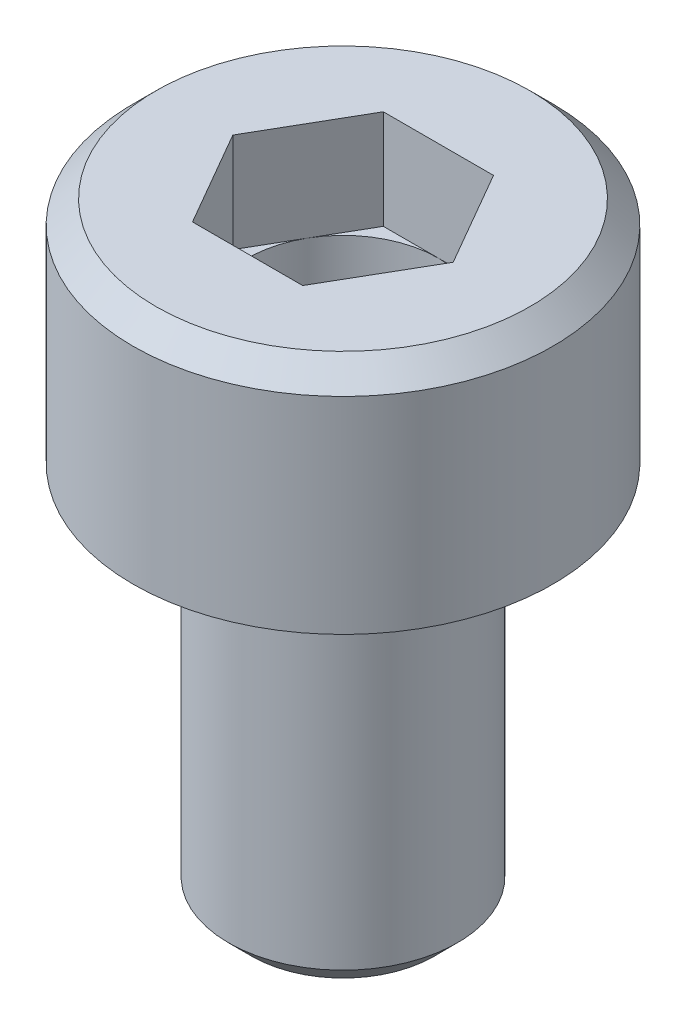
ISO-10303-21;
HEADER;
FILE_DESCRIPTION(('STEP AP214'),'2;1');
FILE_NAME('part.step','',(''),(''),'','','');
FILE_SCHEMA(('AUTOMOTIVE_DESIGN { 1 0 10303 214 1 1 1 1 }'));
ENDSEC;
DATA;
#1=APPLICATION_CONTEXT('core data for automotive mechanical design processes');
#2=APPLICATION_PROTOCOL_DEFINITION('international standard','automotive_design',2000,#1);
#3=PRODUCT_CONTEXT('',#1,'mechanical');
#4=PRODUCT('Part','Part','',(#3));
#5=PRODUCT_RELATED_PRODUCT_CATEGORY('part','',(#4));
#6=PRODUCT_DEFINITION_FORMATION('','',#4);
#7=PRODUCT_DEFINITION_CONTEXT('part definition',#1,'design');
#8=PRODUCT_DEFINITION('design','',#6,#7);
#9=PRODUCT_DEFINITION_SHAPE('','',#8);
#10=(LENGTH_UNIT() NAMED_UNIT(*) SI_UNIT(.MILLI.,.METRE.));
#11=(NAMED_UNIT(*) PLANE_ANGLE_UNIT() SI_UNIT($,.RADIAN.));
#12=(NAMED_UNIT(*) SI_UNIT($,.STERADIAN.) SOLID_ANGLE_UNIT());
#13=UNCERTAINTY_MEASURE_WITH_UNIT(LENGTH_MEASURE(1.E-05),#10,'distance_accuracy_value','');
#14=(GEOMETRIC_REPRESENTATION_CONTEXT(3) GLOBAL_UNCERTAINTY_ASSIGNED_CONTEXT((#13)) GLOBAL_UNIT_ASSIGNED_CONTEXT((#10,
#11,#12)) REPRESENTATION_CONTEXT('',''));
#15=CARTESIAN_POINT('',(0.,0.,0.));
#16=DIRECTION('',(0.,0.,1.));
#17=DIRECTION('',(1.,0.,0.));
#18=AXIS2_PLACEMENT_3D('',#15,#16,#17);
#19=CARTESIAN_POINT('',(0.,1.14999999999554,0.));
#20=DIRECTION('',(0.,1.,0.));
#21=DIRECTION('',(0.,0.,1.));
#22=AXIS2_PLACEMENT_3D('',#19,#20,#21);
#23=CONICAL_SURFACE('',#22,1.25000000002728,1.04719755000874);
#24=CARTESIAN_POINT('',(0.,0.428312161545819,-5.6843418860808E-11));
#25=VERTEX_POINT('',#24);
#26=VERTEX_LOOP('',#25);
#27=FACE_BOUND('',#26,.T.);
#28=CARTESIAN_POINT('',(0.,1.15,0.));
#29=DIRECTION('',(0.,-1.,0.));
#30=DIRECTION('',(0.,0.,-1.));
#31=AXIS2_PLACEMENT_3D('',#28,#29,#30);
#32=CIRCLE('',#31,1.25);
#33=CARTESIAN_POINT('',(0.,1.15,-1.25));
#34=VERTEX_POINT('',#33);
#35=EDGE_CURVE('E99',#34,#34,#32,.F.);
#36=ORIENTED_EDGE('',*,*,#35,.T.);
#37=EDGE_LOOP('',(#36));
#38=FACE_BOUND('',#37,.T.);
#39=ADVANCED_FACE('F17',(#27,#38),#23,.F.);
#40=CARTESIAN_POINT('',(0.,3.,0.));
#41=DIRECTION('',(0.,-1.,0.));
#42=DIRECTION('',(0.,0.,-1.));
#43=AXIS2_PLACEMENT_3D('',#40,#41,#42);
#44=CYLINDRICAL_SURFACE('',#43,1.25);
#45=CARTESIAN_POINT('',(0.,1.7,0.));
#46=DIRECTION('',(0.,-1.,0.));
#47=DIRECTION('',(0.,0.,-1.));
#48=AXIS2_PLACEMENT_3D('',#45,#46,#47);
#49=CIRCLE('',#48,1.25);
#50=CARTESIAN_POINT('',(0.,1.7,-1.25));
#51=VERTEX_POINT('',#50);
#52=CARTESIAN_POINT('',(-1.08253175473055,1.7,-0.625));
#53=VERTEX_POINT('',#52);
#54=EDGE_CURVE('E20',#51,#53,#49,.F.);
#55=ORIENTED_EDGE('',*,*,#54,.T.);
#56=CARTESIAN_POINT('',(0.,1.7,0.));
#57=DIRECTION('',(0.,-1.,0.));
#58=DIRECTION('',(0.,0.,-1.));
#59=AXIS2_PLACEMENT_3D('',#56,#57,#58);
#60=CIRCLE('',#59,1.25);
#61=CARTESIAN_POINT('',(-1.08253175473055,1.7,0.625));
#62=VERTEX_POINT('',#61);
#63=EDGE_CURVE('E94',#53,#62,#60,.F.);
#64=ORIENTED_EDGE('',*,*,#63,.T.);
#65=CARTESIAN_POINT('',(0.,1.7,0.));
#66=DIRECTION('',(0.,-1.,0.));
#67=DIRECTION('',(0.,0.,-1.));
#68=AXIS2_PLACEMENT_3D('',#65,#66,#67);
#69=CIRCLE('',#68,1.25);
#70=CARTESIAN_POINT('',(0.,1.7,1.25));
#71=VERTEX_POINT('',#70);
#72=EDGE_CURVE('E110',#62,#71,#69,.F.);
#73=ORIENTED_EDGE('',*,*,#72,.T.);
#74=CARTESIAN_POINT('',(0.,1.7,0.));
#75=DIRECTION('',(0.,-1.,0.));
#76=DIRECTION('',(0.,0.,-1.));
#77=AXIS2_PLACEMENT_3D('',#74,#75,#76);
#78=CIRCLE('',#77,1.25);
#79=CARTESIAN_POINT('',(1.08253175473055,1.7,0.625));
#80=VERTEX_POINT('',#79);
#81=EDGE_CURVE('E216',#71,#80,#78,.F.);
#82=ORIENTED_EDGE('',*,*,#81,.T.);
#83=CARTESIAN_POINT('',(0.,1.7,0.));
#84=DIRECTION('',(0.,-1.,0.));
#85=DIRECTION('',(0.,0.,-1.));
#86=AXIS2_PLACEMENT_3D('',#83,#84,#85);
#87=CIRCLE('',#86,1.25);
#88=CARTESIAN_POINT('',(1.08253175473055,1.7,-0.625));
#89=VERTEX_POINT('',#88);
#90=EDGE_CURVE('E218',#80,#89,#87,.F.);
#91=ORIENTED_EDGE('',*,*,#90,.T.);
#92=CARTESIAN_POINT('',(0.,1.7,0.));
#93=DIRECTION('',(0.,-1.,0.));
#94=DIRECTION('',(0.,0.,-1.));
#95=AXIS2_PLACEMENT_3D('',#92,#93,#94);
#96=CIRCLE('',#95,1.25);
#97=EDGE_CURVE('E89',#89,#51,#96,.F.);
#98=ORIENTED_EDGE('',*,*,#97,.T.);
#99=EDGE_LOOP('',(#55,#64,#73,#82,#91,#98));
#100=FACE_BOUND('',#99,.T.);
#101=ORIENTED_EDGE('',*,*,#35,.F.);
#102=EDGE_LOOP('',(#101));
#103=FACE_BOUND('',#102,.T.);
#104=ADVANCED_FACE('F92',(#100,#103),#44,.F.);
#105=CARTESIAN_POINT('',(0.,-5.,0.));
#106=DIRECTION('',(0.,-1.,0.));
#107=DIRECTION('',(0.,0.,-1.));
#108=AXIS2_PLACEMENT_3D('',#105,#106,#107);
#109=PLANE('',#108);
#110=CARTESIAN_POINT('',(0.,-4.99999999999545,0.));
#111=DIRECTION('',(0.,1.,0.));
#112=DIRECTION('',(0.,0.,1.));
#113=AXIS2_PLACEMENT_3D('',#110,#111,#112);
#114=CIRCLE('',#113,1.19327499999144);
#115=CARTESIAN_POINT('',(0.,-4.99999999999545,1.19327499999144));
#116=VERTEX_POINT('',#115);
#117=EDGE_CURVE('E109',#116,#116,#114,.T.);
#118=ORIENTED_EDGE('',*,*,#117,.F.);
#119=EDGE_LOOP('',(#118));
#120=FACE_BOUND('',#119,.T.);
#121=ADVANCED_FACE('F431',(#120),#109,.T.);
#122=CARTESIAN_POINT('',(0.,1.7,0.));
#123=DIRECTION('',(0.,-1.,0.));
#124=DIRECTION('',(0.,0.,-1.));
#125=AXIS2_PLACEMENT_3D('',#122,#123,#124);
#126=PLANE('',#125);
#127=DIRECTION('',(-0.5,0.,0.866025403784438));
#128=VECTOR('',#127,1.);
#129=CARTESIAN_POINT('',(-1.08253175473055,1.7,-0.625));
#130=LINE('',#129,#128);
#131=CARTESIAN_POINT('',(-0.721687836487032,1.7,-1.25));
#132=VERTEX_POINT('',#131);
#133=EDGE_CURVE('E113',#132,#53,#130,.T.);
#134=ORIENTED_EDGE('',*,*,#133,.T.);
#135=ORIENTED_EDGE('',*,*,#54,.F.);
#136=DIRECTION('',(-1.,0.,0.));
#137=VECTOR('',#136,1.);
#138=CARTESIAN_POINT('',(0.,1.7,-1.25));
#139=LINE('',#138,#137);
#140=EDGE_CURVE('E116',#51,#132,#139,.T.);
#141=ORIENTED_EDGE('',*,*,#140,.T.);
#142=EDGE_LOOP('',(#134,#135,#141));
#143=FACE_BOUND('',#142,.T.);
#144=ADVANCED_FACE('F114',(#143),#126,.F.);
#145=CARTESIAN_POINT('',(0.,1.7,0.));
#146=DIRECTION('',(0.,-1.,0.));
#147=DIRECTION('',(0.,0.,-1.));
#148=AXIS2_PLACEMENT_3D('',#145,#146,#147);
#149=PLANE('',#148);
#150=DIRECTION('',(-1.,0.,0.));
#151=VECTOR('',#150,1.);
#152=CARTESIAN_POINT('',(0.,1.7,-1.25));
#153=LINE('',#152,#151);
#154=CARTESIAN_POINT('',(0.721687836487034,1.7,-1.25));
#155=VERTEX_POINT('',#154);
#156=EDGE_CURVE('E188',#155,#51,#153,.T.);
#157=ORIENTED_EDGE('',*,*,#156,.T.);
#158=ORIENTED_EDGE('',*,*,#97,.F.);
#159=DIRECTION('',(0.5,0.,0.866025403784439));
#160=VECTOR('',#159,1.);
#161=CARTESIAN_POINT('',(1.08253175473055,1.7,-0.625));
#162=LINE('',#161,#160);
#163=EDGE_CURVE('E179',#155,#89,#162,.T.);
#164=ORIENTED_EDGE('',*,*,#163,.F.);
#165=EDGE_LOOP('',(#157,#158,#164));
#166=FACE_BOUND('',#165,.T.);
#167=ADVANCED_FACE('F225',(#166),#149,.F.);
#168=CARTESIAN_POINT('',(0.,1.7,0.));
#169=DIRECTION('',(0.,-1.,0.));
#170=DIRECTION('',(0.,0.,-1.));
#171=AXIS2_PLACEMENT_3D('',#168,#169,#170);
#172=PLANE('',#171);
#173=DIRECTION('',(0.5,0.,0.866025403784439));
#174=VECTOR('',#173,1.);
#175=CARTESIAN_POINT('',(1.08253175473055,1.7,-0.625));
#176=LINE('',#175,#174);
#177=CARTESIAN_POINT('',(1.44337567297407,1.7,0.));
#178=VERTEX_POINT('',#177);
#179=EDGE_CURVE('E176',#89,#178,#176,.T.);
#180=ORIENTED_EDGE('',*,*,#179,.F.);
#181=ORIENTED_EDGE('',*,*,#90,.F.);
#182=DIRECTION('',(-0.5,0.,0.866025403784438));
#183=VECTOR('',#182,1.);
#184=CARTESIAN_POINT('',(1.08253175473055,1.7,0.625));
#185=LINE('',#184,#183);
#186=EDGE_CURVE('E164',#178,#80,#185,.T.);
#187=ORIENTED_EDGE('',*,*,#186,.F.);
#188=EDGE_LOOP('',(#180,#181,#187));
#189=FACE_BOUND('',#188,.T.);
#190=ADVANCED_FACE('F227',(#189),#172,.F.);
#191=CARTESIAN_POINT('',(0.,1.7,0.));
#192=DIRECTION('',(0.,-1.,0.));
#193=DIRECTION('',(0.,0.,-1.));
#194=AXIS2_PLACEMENT_3D('',#191,#192,#193);
#195=PLANE('',#194);
#196=DIRECTION('',(-0.5,0.,0.866025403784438));
#197=VECTOR('',#196,1.);
#198=CARTESIAN_POINT('',(1.08253175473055,1.7,0.625));
#199=LINE('',#198,#197);
#200=CARTESIAN_POINT('',(0.721687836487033,1.7,1.25));
#201=VERTEX_POINT('',#200);
#202=EDGE_CURVE('E161',#80,#201,#199,.T.);
#203=ORIENTED_EDGE('',*,*,#202,.F.);
#204=ORIENTED_EDGE('',*,*,#81,.F.);
#205=DIRECTION('',(-1.,0.,0.));
#206=VECTOR('',#205,1.);
#207=CARTESIAN_POINT('',(0.,1.7,1.25));
#208=LINE('',#207,#206);
#209=EDGE_CURVE('E149',#201,#71,#208,.T.);
#210=ORIENTED_EDGE('',*,*,#209,.F.);
#211=EDGE_LOOP('',(#203,#204,#210));
#212=FACE_BOUND('',#211,.T.);
#213=ADVANCED_FACE('F270',(#212),#195,.F.);
#214=CARTESIAN_POINT('',(0.,1.7,0.));
#215=DIRECTION('',(0.,-1.,0.));
#216=DIRECTION('',(0.,0.,-1.));
#217=AXIS2_PLACEMENT_3D('',#214,#215,#216);
#218=PLANE('',#217);
#219=DIRECTION('',(-1.,0.,0.));
#220=VECTOR('',#219,1.);
#221=CARTESIAN_POINT('',(0.,1.7,1.25));
#222=LINE('',#221,#220);
#223=CARTESIAN_POINT('',(-0.721687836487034,1.7,1.25));
#224=VERTEX_POINT('',#223);
#225=EDGE_CURVE('E146',#71,#224,#222,.T.);
#226=ORIENTED_EDGE('',*,*,#225,.F.);
#227=ORIENTED_EDGE('',*,*,#72,.F.);
#228=DIRECTION('',(0.5,0.,0.866025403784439));
#229=VECTOR('',#228,1.);
#230=CARTESIAN_POINT('',(-1.08253175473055,1.7,0.625));
#231=LINE('',#230,#229);
#232=EDGE_CURVE('E153',#62,#224,#231,.T.);
#233=ORIENTED_EDGE('',*,*,#232,.T.);
#234=EDGE_LOOP('',(#226,#227,#233));
#235=FACE_BOUND('',#234,.T.);
#236=ADVANCED_FACE('F267',(#235),#218,.F.);
#237=CARTESIAN_POINT('',(0.,1.7,0.));
#238=DIRECTION('',(0.,-1.,0.));
#239=DIRECTION('',(0.,0.,-1.));
#240=AXIS2_PLACEMENT_3D('',#237,#238,#239);
#241=PLANE('',#240);
#242=DIRECTION('',(0.5,0.,0.866025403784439));
#243=VECTOR('',#242,1.);
#244=CARTESIAN_POINT('',(-1.08253175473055,1.7,0.625));
#245=LINE('',#244,#243);
#246=CARTESIAN_POINT('',(-1.44337567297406,1.7,0.));
#247=VERTEX_POINT('',#246);
#248=EDGE_CURVE('E107',#247,#62,#245,.T.);
#249=ORIENTED_EDGE('',*,*,#248,.T.);
#250=ORIENTED_EDGE('',*,*,#63,.F.);
#251=DIRECTION('',(-0.5,0.,0.866025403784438));
#252=VECTOR('',#251,1.);
#253=CARTESIAN_POINT('',(-1.08253175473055,1.7,-0.625));
#254=LINE('',#253,#252);
#255=EDGE_CURVE('E104',#53,#247,#254,.T.);
#256=ORIENTED_EDGE('',*,*,#255,.T.);
#257=EDGE_LOOP('',(#249,#250,#256));
#258=FACE_BOUND('',#257,.T.);
#259=ADVANCED_FACE('F102',(#258),#241,.F.);
#260=CARTESIAN_POINT('',(0.,-4.69327499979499,0.));
#261=DIRECTION('',(0.,1.,0.));
#262=DIRECTION('',(0.,0.,1.));
#263=AXIS2_PLACEMENT_3D('',#260,#261,#262);
#264=CONICAL_SURFACE('',#263,1.49999999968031,0.785398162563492);
#265=ORIENTED_EDGE('',*,*,#117,.T.);
#266=EDGE_LOOP('',(#265));
#267=FACE_BOUND('',#266,.T.);
#268=CARTESIAN_POINT('',(0.,-4.693275,0.));
#269=DIRECTION('',(0.,-1.,0.));
#270=DIRECTION('',(0.,0.,-1.));
#271=AXIS2_PLACEMENT_3D('',#268,#269,#270);
#272=CIRCLE('',#271,1.5);
#273=CARTESIAN_POINT('',(0.,-4.693275,-1.5));
#274=VERTEX_POINT('',#273);
#275=EDGE_CURVE('E136',#274,#274,#272,.F.);
#276=ORIENTED_EDGE('',*,*,#275,.F.);
#277=EDGE_LOOP('',(#276));
#278=FACE_BOUND('',#277,.T.);
#279=ADVANCED_FACE('F387',(#267,#278),#264,.T.);
#280=CARTESIAN_POINT('',(-1.08253175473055,2.5,-0.625));
#281=DIRECTION('',(-0.866025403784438,0.,-0.5));
#282=DIRECTION('',(-0.5,0.,0.866025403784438));
#283=AXIS2_PLACEMENT_3D('',#280,#281,#282);
#284=PLANE('',#283);
#285=DIRECTION('',(0.,1.,0.));
#286=VECTOR('',#285,1.);
#287=CARTESIAN_POINT('',(-0.721687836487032,3.,-1.25));
#288=LINE('',#287,#286);
#289=CARTESIAN_POINT('',(-0.721687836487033,3.,-1.25));
#290=VERTEX_POINT('',#289);
#291=EDGE_CURVE('E192',#132,#290,#288,.T.);
#292=ORIENTED_EDGE('',*,*,#291,.T.);
#293=DIRECTION('',(0.499999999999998,0.,-0.86602540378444));
#294=VECTOR('',#293,1.);
#295=CARTESIAN_POINT('',(-1.44337567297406,3.,0.));
#296=LINE('',#295,#294);
#297=CARTESIAN_POINT('',(-1.44337567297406,3.,0.));
#298=VERTEX_POINT('',#297);
#299=EDGE_CURVE('E132',#298,#290,#296,.T.);
#300=ORIENTED_EDGE('',*,*,#299,.F.);
#301=DIRECTION('',(0.,1.,0.));
#302=VECTOR('',#301,1.);
#303=CARTESIAN_POINT('',(-1.44337567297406,2.5,0.));
#304=LINE('',#303,#302);
#305=EDGE_CURVE('E122',#298,#247,#304,.F.);
#306=ORIENTED_EDGE('',*,*,#305,.T.);
#307=ORIENTED_EDGE('',*,*,#255,.F.);
#308=ORIENTED_EDGE('',*,*,#133,.F.);
#309=EDGE_LOOP('',(#292,#300,#306,#307,#308));
#310=FACE_BOUND('',#309,.T.);
#311=ADVANCED_FACE('F120',(#310),#284,.F.);
#312=CARTESIAN_POINT('',(0.,3.,-1.25));
#313=DIRECTION('',(0.,0.,-1.));
#314=DIRECTION('',(-1.,0.,0.));
#315=AXIS2_PLACEMENT_3D('',#312,#313,#314);
#316=PLANE('',#315);
#317=DIRECTION('',(0.,1.,0.));
#318=VECTOR('',#317,1.);
#319=CARTESIAN_POINT('',(0.721687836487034,2.5,-1.25));
#320=LINE('',#319,#318);
#321=CARTESIAN_POINT('',(0.721687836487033,3.,-1.25));
#322=VERTEX_POINT('',#321);
#323=EDGE_CURVE('E173',#322,#155,#320,.F.);
#324=ORIENTED_EDGE('',*,*,#323,.F.);
#325=DIRECTION('',(1.,0.,0.));
#326=VECTOR('',#325,1.);
#327=CARTESIAN_POINT('',(0.,3.,-1.25));
#328=LINE('',#327,#326);
#329=EDGE_CURVE('E135',#290,#322,#328,.T.);
#330=ORIENTED_EDGE('',*,*,#329,.F.);
#331=ORIENTED_EDGE('',*,*,#291,.F.);
#332=ORIENTED_EDGE('',*,*,#140,.F.);
#333=ORIENTED_EDGE('',*,*,#156,.F.);
#334=EDGE_LOOP('',(#324,#330,#331,#332,#333));
#335=FACE_BOUND('',#334,.T.);
#336=ADVANCED_FACE('F236',(#335),#316,.F.);
#337=CARTESIAN_POINT('',(1.08253175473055,2.5,-0.625));
#338=DIRECTION('',(-0.866025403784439,0.,0.5));
#339=DIRECTION('',(0.5,0.,0.866025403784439));
#340=AXIS2_PLACEMENT_3D('',#337,#338,#339);
#341=PLANE('',#340);
#342=DIRECTION('',(0.499999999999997,0.,0.86602540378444));
#343=VECTOR('',#342,1.);
#344=CARTESIAN_POINT('',(0.721687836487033,3.,-1.25));
#345=LINE('',#344,#343);
#346=CARTESIAN_POINT('',(1.44337567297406,3.,0.));
#347=VERTEX_POINT('',#346);
#348=EDGE_CURVE('E232',#322,#347,#345,.T.);
#349=ORIENTED_EDGE('',*,*,#348,.F.);
#350=ORIENTED_EDGE('',*,*,#323,.T.);
#351=ORIENTED_EDGE('',*,*,#163,.T.);
#352=ORIENTED_EDGE('',*,*,#179,.T.);
#353=DIRECTION('',(0.,1.,0.));
#354=VECTOR('',#353,1.);
#355=CARTESIAN_POINT('',(1.44337567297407,2.5,0.));
#356=LINE('',#355,#354);
#357=EDGE_CURVE('E158',#347,#178,#356,.F.);
#358=ORIENTED_EDGE('',*,*,#357,.F.);
#359=EDGE_LOOP('',(#349,#350,#351,#352,#358));
#360=FACE_BOUND('',#359,.T.);
#361=ADVANCED_FACE('F230',(#360),#341,.T.);
#362=CARTESIAN_POINT('',(1.08253175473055,2.5,0.625));
#363=DIRECTION('',(-0.866025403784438,0.,-0.5));
#364=DIRECTION('',(-0.5,0.,0.866025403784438));
#365=AXIS2_PLACEMENT_3D('',#362,#363,#364);
#366=PLANE('',#365);
#367=DIRECTION('',(-0.499999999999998,0.,0.86602540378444));
#368=VECTOR('',#367,1.);
#369=CARTESIAN_POINT('',(1.44337567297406,3.,0.));
#370=LINE('',#369,#368);
#371=CARTESIAN_POINT('',(0.721687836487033,3.,1.25));
#372=VERTEX_POINT('',#371);
#373=EDGE_CURVE('E245',#347,#372,#370,.T.);
#374=ORIENTED_EDGE('',*,*,#373,.F.);
#375=ORIENTED_EDGE('',*,*,#357,.T.);
#376=ORIENTED_EDGE('',*,*,#186,.T.);
#377=ORIENTED_EDGE('',*,*,#202,.T.);
#378=DIRECTION('',(0.,1.,0.));
#379=VECTOR('',#378,1.);
#380=CARTESIAN_POINT('',(0.721687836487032,3.,1.25));
#381=LINE('',#380,#379);
#382=EDGE_CURVE('E148',#372,#201,#381,.F.);
#383=ORIENTED_EDGE('',*,*,#382,.F.);
#384=EDGE_LOOP('',(#374,#375,#376,#377,#383));
#385=FACE_BOUND('',#384,.T.);
#386=ADVANCED_FACE('F272',(#385),#366,.T.);
#387=CARTESIAN_POINT('',(0.,3.,1.25));
#388=DIRECTION('',(0.,0.,-1.));
#389=DIRECTION('',(-1.,0.,0.));
#390=AXIS2_PLACEMENT_3D('',#387,#388,#389);
#391=PLANE('',#390);
#392=DIRECTION('',(1.,0.,0.));
#393=VECTOR('',#392,1.);
#394=CARTESIAN_POINT('',(0.,3.,1.25));
#395=LINE('',#394,#393);
#396=CARTESIAN_POINT('',(-0.721687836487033,3.,1.25));
#397=VERTEX_POINT('',#396);
#398=EDGE_CURVE('E143',#372,#397,#395,.F.);
#399=ORIENTED_EDGE('',*,*,#398,.F.);
#400=ORIENTED_EDGE('',*,*,#382,.T.);
#401=ORIENTED_EDGE('',*,*,#209,.T.);
#402=ORIENTED_EDGE('',*,*,#225,.T.);
#403=DIRECTION('',(0.,1.,0.));
#404=VECTOR('',#403,1.);
#405=CARTESIAN_POINT('',(-0.721687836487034,2.5,1.25));
#406=LINE('',#405,#404);
#407=EDGE_CURVE('E35',#224,#397,#406,.T.);
#408=ORIENTED_EDGE('',*,*,#407,.T.);
#409=EDGE_LOOP('',(#399,#400,#401,#402,#408));
#410=FACE_BOUND('',#409,.T.);
#411=ADVANCED_FACE('F268',(#410),#391,.T.);
#412=CARTESIAN_POINT('',(-1.08253175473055,2.5,0.625));
#413=DIRECTION('',(-0.866025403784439,0.,0.5));
#414=DIRECTION('',(0.5,0.,0.866025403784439));
#415=AXIS2_PLACEMENT_3D('',#412,#413,#414);
#416=PLANE('',#415);
#417=ORIENTED_EDGE('',*,*,#305,.F.);
#418=DIRECTION('',(-0.499999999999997,0.,-0.86602540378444));
#419=VECTOR('',#418,1.);
#420=CARTESIAN_POINT('',(-0.721687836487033,3.,1.25));
#421=LINE('',#420,#419);
#422=EDGE_CURVE('E139',#397,#298,#421,.T.);
#423=ORIENTED_EDGE('',*,*,#422,.F.);
#424=ORIENTED_EDGE('',*,*,#407,.F.);
#425=ORIENTED_EDGE('',*,*,#232,.F.);
#426=ORIENTED_EDGE('',*,*,#248,.F.);
#427=EDGE_LOOP('',(#417,#423,#424,#425,#426));
#428=FACE_BOUND('',#427,.T.);
#429=ADVANCED_FACE('F239',(#428),#416,.F.);
#430=CARTESIAN_POINT('',(0.,0.,0.));
#431=DIRECTION('',(0.,-1.,0.));
#432=DIRECTION('',(0.,0.,-1.));
#433=AXIS2_PLACEMENT_3D('',#430,#431,#432);
#434=CYLINDRICAL_SURFACE('',#433,1.5);
#435=CARTESIAN_POINT('',(0.,-0.1,0.));
#436=DIRECTION('',(0.,-1.,0.));
#437=DIRECTION('',(0.,0.,1.));
#438=AXIS2_PLACEMENT_3D('',#435,#436,#437);
#439=CIRCLE('',#438,1.5);
#440=CARTESIAN_POINT('',(0.,-0.1,1.5));
#441=VERTEX_POINT('',#440);
#442=EDGE_CURVE('E142',#441,#441,#439,.T.);
#443=ORIENTED_EDGE('',*,*,#442,.T.);
#444=EDGE_LOOP('',(#443));
#445=FACE_BOUND('',#444,.T.);
#446=ORIENTED_EDGE('',*,*,#275,.T.);
#447=EDGE_LOOP('',(#446));
#448=FACE_BOUND('',#447,.T.);
#449=ADVANCED_FACE('F318',(#445,#448),#434,.T.);
#450=CARTESIAN_POINT('',(0.,3.,0.));
#451=DIRECTION('',(0.,1.,0.));
#452=DIRECTION('',(0.,0.,1.));
#453=AXIS2_PLACEMENT_3D('',#450,#451,#452);
#454=PLANE('',#453);
#455=ORIENTED_EDGE('',*,*,#398,.T.);
#456=ORIENTED_EDGE('',*,*,#422,.T.);
#457=ORIENTED_EDGE('',*,*,#299,.T.);
#458=ORIENTED_EDGE('',*,*,#329,.T.);
#459=ORIENTED_EDGE('',*,*,#348,.T.);
#460=ORIENTED_EDGE('',*,*,#373,.T.);
#461=EDGE_LOOP('',(#455,#456,#457,#458,#459,#460));
#462=FACE_BOUND('',#461,.T.);
#463=CARTESIAN_POINT('',(0.,3.00000000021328,0.));
#464=DIRECTION('',(0.,-1.,0.));
#465=DIRECTION('',(0.,0.,-1.));
#466=AXIS2_PLACEMENT_3D('',#463,#464,#465);
#467=CIRCLE('',#466,2.45000000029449);
#468=CARTESIAN_POINT('',(0.,3.00000000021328,-2.45000000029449));
#469=VERTEX_POINT('',#468);
#470=EDGE_CURVE('E211',#469,#469,#467,.T.);
#471=ORIENTED_EDGE('',*,*,#470,.F.);
#472=EDGE_LOOP('',(#471));
#473=FACE_BOUND('',#472,.T.);
#474=ADVANCED_FACE('F241',(#462,#473),#454,.T.);
#475=CARTESIAN_POINT('',(0.,-0.1,0.));
#476=DIRECTION('',(0.,-1.,0.));
#477=DIRECTION('',(0.,0.,1.));
#478=AXIS2_PLACEMENT_3D('',#475,#476,#477);
#479=TOROIDAL_SURFACE('',#478,1.6,0.1);
#480=ORIENTED_EDGE('',*,*,#442,.F.);
#481=EDGE_LOOP('',(#480));
#482=FACE_BOUND('',#481,.T.);
#483=CARTESIAN_POINT('',(0.,0.,0.));
#484=DIRECTION('',(0.,-1.,0.));
#485=DIRECTION('',(0.,0.,-1.));
#486=AXIS2_PLACEMENT_3D('',#483,#484,#485);
#487=CIRCLE('',#486,1.6);
#488=CARTESIAN_POINT('',(0.,0.,-1.6));
#489=VERTEX_POINT('',#488);
#490=EDGE_CURVE('E213',#489,#489,#487,.F.);
#491=ORIENTED_EDGE('',*,*,#490,.F.);
#492=EDGE_LOOP('',(#491));
#493=FACE_BOUND('',#492,.T.);
#494=ADVANCED_FACE('F311',(#482,#493),#479,.F.);
#495=CARTESIAN_POINT('',(0.,2.69999999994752,0.));
#496=DIRECTION('',(0.,-1.,0.));
#497=DIRECTION('',(0.,0.,-1.));
#498=AXIS2_PLACEMENT_3D('',#495,#496,#497);
#499=CONICAL_SURFACE('',#498,2.74999999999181,0.785398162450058);
#500=CARTESIAN_POINT('',(0.,2.7,0.));
#501=DIRECTION('',(0.,1.,0.));
#502=DIRECTION('',(0.,0.,1.));
#503=AXIS2_PLACEMENT_3D('',#500,#501,#502);
#504=CIRCLE('',#503,2.75);
#505=CARTESIAN_POINT('',(0.,2.7,2.75));
#506=VERTEX_POINT('',#505);
#507=EDGE_CURVE('E26',#506,#506,#504,.F.);
#508=ORIENTED_EDGE('',*,*,#507,.F.);
#509=EDGE_LOOP('',(#508));
#510=FACE_BOUND('',#509,.T.);
#511=ORIENTED_EDGE('',*,*,#470,.T.);
#512=EDGE_LOOP('',(#511));
#513=FACE_BOUND('',#512,.T.);
#514=ADVANCED_FACE('F290',(#510,#513),#499,.T.);
#515=CARTESIAN_POINT('',(0.,0.,0.));
#516=DIRECTION('',(0.,-1.,0.));
#517=DIRECTION('',(0.,0.,-1.));
#518=AXIS2_PLACEMENT_3D('',#515,#516,#517);
#519=PLANE('',#518);
#520=CARTESIAN_POINT('',(0.,0.,0.));
#521=DIRECTION('',(0.,1.,0.));
#522=DIRECTION('',(0.,0.,1.));
#523=AXIS2_PLACEMENT_3D('',#520,#521,#522);
#524=CIRCLE('',#523,2.75);
#525=CARTESIAN_POINT('',(0.,0.,2.75));
#526=VERTEX_POINT('',#525);
#527=EDGE_CURVE('E11',#526,#526,#524,.T.);
#528=ORIENTED_EDGE('',*,*,#527,.F.);
#529=EDGE_LOOP('',(#528));
#530=FACE_BOUND('',#529,.T.);
#531=ORIENTED_EDGE('',*,*,#490,.T.);
#532=EDGE_LOOP('',(#531));
#533=FACE_BOUND('',#532,.T.);
#534=ADVANCED_FACE('F284',(#530,#533),#519,.T.);
#535=CARTESIAN_POINT('',(0.,0.,0.));
#536=DIRECTION('',(0.,1.,0.));
#537=DIRECTION('',(0.,0.,1.));
#538=AXIS2_PLACEMENT_3D('',#535,#536,#537);
#539=CYLINDRICAL_SURFACE('',#538,2.75);
#540=ORIENTED_EDGE('',*,*,#527,.T.);
#541=EDGE_LOOP('',(#540));
#542=FACE_BOUND('',#541,.T.);
#543=ORIENTED_EDGE('',*,*,#507,.T.);
#544=EDGE_LOOP('',(#543));
#545=FACE_BOUND('',#544,.T.);
#546=ADVANCED_FACE('F282',(#542,#545),#539,.T.);
#547=CLOSED_SHELL('',(#39,#104,#121,#144,#167,#190,#213,#236,#259,#279,#311,#336,#361,#386,#411,
#429,#449,#474,#494,#514,#534,#546));
#548=MANIFOLD_SOLID_BREP('B1',#547);
#549=ADVANCED_BREP_SHAPE_REPRESENTATION('',(#18,#548),#14);
#550=SHAPE_DEFINITION_REPRESENTATION(#9,#549);
ENDSEC;
END-ISO-10303-21;
